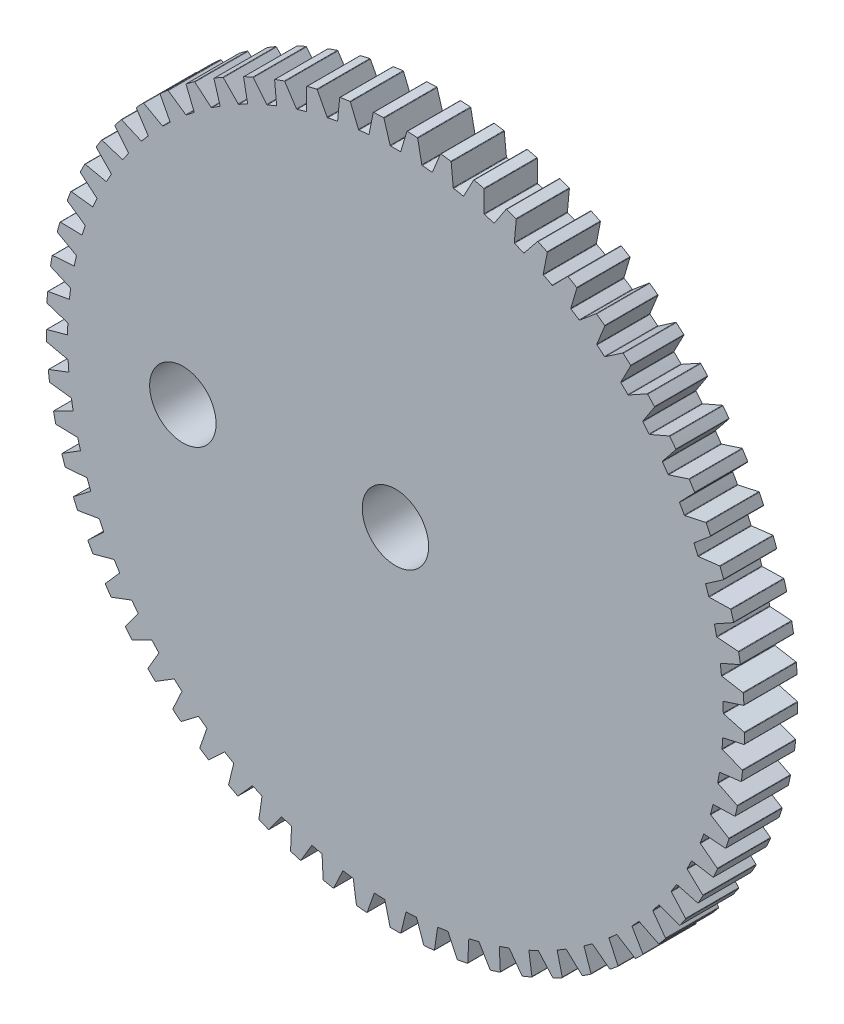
from build123d import *

# Parameters (mm, degrees)
SKETCH1_R          = 16.6878
EXTRUDE1_DEPTH     = 2.54
SKETCH2_R          = 1.5875
CUT_EXTRUDE1_DEPTH = 2.54
SKETCH3_R          = 17.878733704
CUT_EXTRUDE2_DEPTH = 42.277133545


with BuildPart() as part:
    # Sketch1 → Extrude1 (new body)
    with BuildSketch(Plane.XY):
        with Locations((-19.05, -3.81)):
            Circle(SKETCH1_R)
    extrude(amount=EXTRUDE1_DEPTH)

    # Sketch2 → Cut-Extrude1 (cut)
    with BuildSketch(Plane.XY.offset(2.54)):
        with Locations((-19.05, -3.81)):
            Circle(SKETCH2_R)
        with Locations((-29.21, -3.81)):
            Circle(SKETCH2_R)
    extrude(amount=-CUT_EXTRUDE1_DEPTH, mode=Mode.SUBTRACT)

    # Sketch3 → Cut-Extrude2 (cut, through all)
    with BuildSketch(Plane.XY.offset(2.54)):
        with Locations((-19.05, -3.81)):
            Circle(SKETCH3_R)
        with BuildLine():
            Line((-18.791282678, -20.476880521), (-18.546628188, -19.492192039))
            ThreePointArc((-18.546628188, -19.492192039), (-18.537958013, -19.478573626), (-18.52283206, -19.472931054))
            ThreePointArc((-18.52283206, -19.472931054), (-18.293052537, -19.463509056), (-18.063016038, -19.450689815))
            ThreePointArc((-18.063016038, -19.450689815), (-18.047416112, -19.454846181), (-18.037472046, -19.467564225))
            Line((-18.037472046, -19.467564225), (-17.698923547, -20.424043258))
            ThreePointArc((-17.698923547, -20.424043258), (-17.688771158, -20.436897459), (-17.672883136, -20.440881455))
            ThreePointArc((-17.672883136, -20.440881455), (-17.439394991, -20.419895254), (-17.206224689, -20.395631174))
            ThreePointArc((-17.206224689, -20.395631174), (-17.191398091, -20.388668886), (-17.183904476, -20.374103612))
            Line((-17.183904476, -20.374103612), (-17.035428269, -19.370399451))
            ThreePointArc((-17.035428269, -19.370399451), (-17.028112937, -19.356007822), (-17.014019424, -19.3489864))
            ThreePointArc((-17.014019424, -19.3489864), (-16.785804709, -19.317376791), (-16.55807934, -19.28241567))
            ThreePointArc((-16.55807934, -19.28241567), (-16.542151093, -19.285047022), (-16.531025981, -19.296745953))
            Line((-16.531025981, -19.296745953), (-16.101744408, -20.216085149))
            ThreePointArc((-16.101744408, -20.216085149), (-16.090398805, -20.227899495), (-16.074200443, -20.230331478))
            ThreePointArc((-16.074200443, -20.230331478), (-15.843827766, -20.186908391), (-15.614087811, -20.140253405))
            ThreePointArc((-15.614087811, -20.140253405), (-15.600002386, -20.131892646), (-15.593949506, -20.11667213))
            Line((-15.593949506, -20.11667213), (-15.543037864, -19.103323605))
            ThreePointArc((-15.543037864, -19.103323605), (-15.537145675, -19.08829313), (-15.52379562, -19.079944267))
            ThreePointArc((-15.52379562, -19.079944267), (-15.299697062, -19.026456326), (-15.076409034, -18.969679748))
            ThreePointArc((-15.076409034, -18.969679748), (-15.060301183, -18.970761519), (-15.048098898, -18.981332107))
            Line((-15.048098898, -18.981332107), (-14.532092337, -19.854947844))
            ThreePointArc((-14.532092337, -19.854947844), (-14.519659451, -19.865612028), (-14.503301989, -19.866469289))
            ThreePointArc((-14.503301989, -19.866469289), (-14.278195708, -19.801014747), (-14.054031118, -19.73240446))
            ThreePointArc((-14.054031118, -19.73240446), (-14.040818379, -19.722723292), (-14.036262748, -19.706989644))
            Line((-14.036262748, -19.706989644), (-14.083391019, -18.693458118))
            ThreePointArc((-14.083391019, -18.693458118), (-14.078976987, -18.677929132), (-14.066495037, -18.668330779))
            ThreePointArc((-14.066495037, -18.668330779), (-13.848604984, -18.593463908), (-13.631839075, -18.515401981))
            ThreePointArc((-13.631839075, -18.515401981), (-13.615702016, -18.51492407), (-13.602536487, -18.52426762))
            Line((-13.602536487, -18.52426762), (-13.004622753, -19.344003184))
            ThreePointArc((-13.004622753, -19.344003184), (-12.991218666, -19.353417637), (-12.974854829, -19.352692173))
            ThreePointArc((-12.974854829, -19.352692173), (-12.757116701, -19.265817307), (-12.540620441, -19.175892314))
            ThreePointArc((-12.540620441, -19.175892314), (-12.528403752, -19.164981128), (-12.525387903, -19.148881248))
            Line((-12.525387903, -19.148881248), (-12.670116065, -18.144629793))
            ThreePointArc((-12.670116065, -18.144629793), (-12.667221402, -18.128747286), (-12.655724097, -18.117989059))
            ThreePointArc((-12.655724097, -18.117989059), (-12.446076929, -18.022442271), (-12.237857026, -17.923823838))
            ThreePointArc((-12.237857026, -17.923823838), (-12.221841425, -17.921790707), (-12.207835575, -17.929819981))
            Line((-12.207835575, -17.929819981), (-11.533597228, -18.688021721))
            ThreePointArc((-11.533597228, -18.688021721), (-11.51934709, -18.696098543), (-11.503129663, -18.693797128))
            ThreePointArc((-11.503129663, -18.693797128), (-11.29479265, -18.586313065), (-11.087986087, -18.475912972))
            ThreePointArc((-11.087986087, -18.475912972), (-11.076879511, -18.463873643), (-11.075431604, -18.447557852))
            Line((-11.075431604, -18.447557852), (-11.316408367, -17.461962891))
            ThreePointArc((-11.316408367, -17.461962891), (-11.3150601, -17.445875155), (-11.304654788, -17.434057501))
            ThreePointArc((-11.304654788, -17.434057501), (-11.105207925, -17.31872289), (-10.90747812, -17.200468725))
            ThreePointArc((-10.90747812, -17.200468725), (-10.891733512, -17.196899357), (-10.877018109, -17.203539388))
            Line((-10.877018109, -17.203539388), (-10.13275033, -17.893128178))
            ThreePointArc((-10.13275033, -17.893128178), (-10.117787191, -17.899791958), (-10.101867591, -17.895936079))
            ThreePointArc((-10.101867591, -17.895936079), (-9.90487688, -17.768846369), (-9.709690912, -17.639001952))
            ThreePointArc((-9.709690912, -17.639001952), (-9.699798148, -17.625946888), (-9.699931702, -17.609567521))
            Line((-9.699931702, -17.609567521), (-10.034907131, -16.65183129))
            ThreePointArc((-10.034907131, -16.65183129), (-10.035117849, -16.635688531), (-10.025901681, -16.622921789))
            ThreePointArc((-10.025901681, -16.622921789), (-9.838517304, -16.488876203), (-9.653123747, -16.352090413))
            ThreePointArc((-9.653123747, -16.352090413), (-9.637797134, -16.347018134), (-9.622509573, -16.352206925))
            Line((-9.622509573, -16.352206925), (-8.815161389, -16.966744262))
            ThreePointArc((-8.815161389, -16.966744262), (-8.799624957, -16.971932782), (-8.784151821, -16.966558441))
            ThreePointArc((-8.784151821, -16.966558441), (-8.600346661, -16.821049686), (-8.418603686, -16.672973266))
            ThreePointArc((-8.418603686, -16.672973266), (-8.4100171, -16.659024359), (-8.411730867, -16.642734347))
            Line((-8.411730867, -16.642734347), (-8.837577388, -15.721798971))
            ThreePointArc((-8.837577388, -15.721798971), (-8.839345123, -15.705751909), (-8.831404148, -15.692155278))
            ThreePointArc((-8.831404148, -15.692155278), (-8.657831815, -15.540650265), (-8.486505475, -15.386609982))
            ThreePointArc((-8.486505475, -15.386609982), (-8.471739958, -15.380082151), (-8.456022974, -15.383771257))
            Line((-8.456022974, -15.383771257), (-7.59313238, -15.91751937))
            ThreePointArc((-7.59313238, -15.91751937), (-7.577167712, -15.921184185), (-7.562285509, -15.914341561))
            ThreePointArc((-7.562285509, -15.914341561), (-7.393382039, -15.751772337), (-7.226778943, -15.586846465))
            ThreePointArc((-7.226778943, -15.586846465), (-7.219578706, -15.572133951), (-7.222856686, -15.55608539))
            Line((-7.222856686, -15.55608539), (-7.735598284, -14.680549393))
            ThreePointArc((-7.735598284, -14.680549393), (-7.738906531, -14.664747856), (-7.732314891, -14.650448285))
            ThreePointArc((-7.732314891, -14.650448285), (-7.5741752, -14.482898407), (-7.418515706, -14.313041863))
            ThreePointArc((-7.418515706, -14.313041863), (-7.404449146, -14.305119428), (-7.388449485, -14.307274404))
            Line((-7.388449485, -14.307274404), (-6.478073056, -14.755249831))
            ThreePointArc((-6.478073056, -14.755249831), (-6.461829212, -14.757356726), (-6.447676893, -14.749109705))
            ThreePointArc((-6.447676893, -14.749109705), (-6.295252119, -14.570997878), (-6.145344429, -14.390762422))
            ThreePointArc((-6.145344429, -14.390762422), (-6.139597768, -14.375423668), (-6.144409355, -14.359766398))
            Line((-6.144409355, -14.359766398), (-6.739258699, -13.537804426))
            ThreePointArc((-6.739258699, -13.537804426), (-6.744076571, -13.522395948), (-6.738895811, -13.507526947))
            ThreePointArc((-6.738895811, -13.507526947), (-6.597665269, -13.325496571), (-6.459125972, -13.141409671))
            ThreePointArc((-6.459125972, -13.141409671), (-6.445889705, -13.132166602), (-6.429756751, -13.132767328))
            Line((-6.429756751, -13.132767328), (-5.480394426, -13.490787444))
            ThreePointArc((-5.480394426, -13.490787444), (-5.46402307, -13.491316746), (-5.450732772, -13.48174233))
            ThreePointArc((-5.450732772, -13.48174233), (-5.316209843, -13.289750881), (-5.184397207, -13.095888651))
            ThreePointArc((-5.184397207, -13.095888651), (-5.180157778, -13.080066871), (-5.186458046, -13.06494708))
            Line((-5.186458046, -13.06494708), (-5.857861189, -12.304233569))
            ThreePointArc((-5.857861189, -12.304233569), (-5.864143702, -12.289362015), (-5.860422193, -12.274062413))
            ThreePointArc((-5.860422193, -12.274062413), (-5.737419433, -12.079251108), (-5.617293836, -11.882652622))
            ThreePointArc((-5.617293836, -11.882652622), (-5.605011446, -11.872175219), (-5.588895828, -11.871216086))
            Line((-5.588895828, -11.871216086), (-4.609411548, -12.135938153))
            ThreePointArc((-4.609411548, -12.135938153), (-4.593065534, -12.13488492), (-4.580761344, -12.124072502))
            ThreePointArc((-4.580761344, -12.124072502), (-4.465396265, -11.919994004), (-4.352909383, -11.714315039))
            ThreePointArc((-4.352909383, -11.714315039), (-4.350216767, -11.698157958), (-4.357946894, -11.683716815))
            Line((-4.357946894, -11.683716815), (-5.099635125, -10.991354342))
            ThreePointArc((-5.099635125, -10.991354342), (-5.107323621, -10.977158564), (-5.10509611, -10.961571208))
            ThreePointArc((-5.10509611, -10.961571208), (-5.001469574, -10.755797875), (-4.900879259, -10.548523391))
            ThreePointArc((-4.900879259, -10.548523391), (-4.889665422, -10.536909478), (-4.873717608, -10.534399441))
            Line((-4.873717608, -10.534399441), (-3.873256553, -10.70335182))
            ThreePointArc((-3.873256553, -10.70335182), (-3.8570885, -10.700725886), (-3.8458853, -10.688776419))
            ThreePointArc((-3.8458853, -10.688776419), (-3.750755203, -10.474516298), (-3.658644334, -10.258940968))
            ThreePointArc((-3.658644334, -10.258940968), (-3.657523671, -10.242599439), (-3.666611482, -10.228971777))
            Line((-3.666611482, -10.228971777), (-4.471659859, -9.611424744))
            ThreePointArc((-4.471659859, -9.611424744), (-4.480682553, -9.598037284), (-4.479969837, -9.58230771))
            ThreePointArc((-4.479969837, -9.58230771), (-4.396687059, -9.367493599), (-4.316571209, -9.151478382))
            ThreePointArc((-4.316571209, -9.151478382), (-4.306530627, -9.138836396), (-4.290899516, -9.134798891))
            Line((-4.290899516, -9.134798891), (-3.278802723, -9.206404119))
            ThreePointArc((-3.278802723, -9.206404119), (-3.262963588, -9.202230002), (-3.252965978, -9.189255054))
            ThreePointArc((-3.252965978, -9.189255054), (-3.178959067, -8.966813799), (-3.108084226, -8.743354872))
            ThreePointArc((-3.108084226, -8.743354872), (-3.10854598, -8.726981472), (-3.118906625, -8.714294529))
            Line((-3.118906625, -8.714294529), (-3.979798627, -8.177328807))
            ThreePointArc((-3.979798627, -8.177328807), (-3.990071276, -8.16487466), (-3.990880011, -8.14914973))
            ThreePointArc((-3.990880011, -8.14914973), (-3.928718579, -7.927300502), (-3.869825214, -7.704561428))
            ThreePointArc((-3.869825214, -7.704561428), (-3.861051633, -7.691009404), (-3.845883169, -7.685482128))
            Line((-3.845883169, -7.685482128), (-2.831600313, -7.659071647))
            ThreePointArc((-2.831600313, -7.659071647), (-2.81623798, -7.653388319), (-2.807539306, -7.639509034))
            ThreePointArc((-2.807539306, -7.639509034), (-2.755346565, -7.410963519), (-2.70636949, -7.181707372))
            ThreePointArc((-2.70636949, -7.181707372), (-2.708409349, -7.165454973), (-2.719946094, -7.153827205))
            Line((-2.719946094, -7.153827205), (-3.628643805, -6.702456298))
            ThreePointArc((-3.628643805, -6.702456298), (-3.640070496, -6.691051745), (-3.64239313, -6.675478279))
            ThreePointArc((-3.64239313, -6.675478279), (-3.601933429, -6.448665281), (-3.564812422, -6.221282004))
            ThreePointArc((-3.564812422, -6.221282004), (-3.557387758, -6.206946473), (-3.542823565, -6.199981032))
            Line((-3.542823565, -6.199981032), (-2.53582473, -6.07580143))
            ThreePointArc((-2.53582473, -6.07580143), (-2.521082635, -6.068661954), (-2.513764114, -6.05400792))
            ThreePointArc((-2.513764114, -6.05400792), (-2.483872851, -5.821492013), (-2.457250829, -5.588579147))
            ThreePointArc((-2.457250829, -5.588579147), (-2.460849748, -5.572599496), (-2.473454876, -5.562139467))
            Line((-2.473454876, -5.562139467), (-3.421474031, -5.200577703))
            ThreePointArc((-3.421474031, -5.200577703), (-3.433948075, -5.190329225), (-3.437762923, -5.175052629))
            ThreePointArc((-3.437762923, -5.175052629), (-3.419382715, -4.945393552), (-3.404380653, -4.71548909))
            ThreePointArc((-3.404380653, -4.71548909), (-3.398374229, -4.700503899), (-3.384550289, -4.692165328))
            Line((-3.384550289, -4.692165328), (-2.394237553, -4.471376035))
            ThreePointArc((-2.394237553, -4.471376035), (-2.380253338, -4.462847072), (-2.3743833, -4.447555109))
            ThreePointArc((-2.3743833, -4.447555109), (-2.367072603, -4.213239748), (-2.363054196, -3.978844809))
            ThreePointArc((-2.363054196, -3.978844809), (-2.368178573, -3.963287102), (-2.381734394, -3.954092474))
            Line((-2.381734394, -3.954092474), (-3.360223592, -3.685715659))
            ThreePointArc((-3.360223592, -3.685715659), (-3.373628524, -3.676718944), (-3.378899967, -3.66188185))
            ThreePointArc((-3.378899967, -3.66188185), (-3.382770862, -3.431520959), (-3.390027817, -3.201241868))
            ThreePointArc((-3.390027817, -3.201241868), (-3.385495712, -3.18574693), (-3.372541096, -3.176113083))
            Line((-3.372541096, -3.176113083), (-2.408160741, -2.860775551))
            ThreePointArc((-2.408160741, -2.860775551), (-2.395064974, -2.850936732), (-2.390698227, -2.835149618))
            ThreePointArc((-2.390698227, -2.835149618), (-2.406036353, -2.601222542), (-2.42465908, -2.367534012))
            ThreePointArc((-2.42465908, -2.367534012), (-2.431261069, -2.352543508), (-2.445641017, -2.34470013))
            Line((-2.445641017, -2.34470013), (-3.445464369, -2.172014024))
            ThreePointArc((-3.445464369, -2.172014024), (-3.45967503, -2.164353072), (-3.466353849, -2.15009401))
            ThreePointArc((-3.466353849, -2.15009401), (-3.492439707, -1.921182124), (-3.521887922, -1.692678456))
            ThreePointArc((-3.521887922, -1.692678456), (-3.518872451, -1.676818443), (-3.506908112, -1.66597927))
            Line((-3.506908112, -1.66597927), (-2.5774643, -1.259037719))
            ThreePointArc((-2.5774643, -1.259037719), (-2.565379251, -1.247980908), (-2.562556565, -1.231846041))
            ThreePointArc((-2.562556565, -1.231846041), (-2.600400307, -1.000491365), (-2.641490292, -0.769691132))
            ThreePointArc((-2.641490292, -0.769691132), (-2.649508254, -0.755407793), (-2.664578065, -0.748988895))
            Line((-2.664578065, -0.748988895), (-3.67640049, -0.673605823))
            ThreePointArc((-3.67640049, -0.673605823), (-3.691284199, -0.667352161), (-3.699308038, -0.653804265))
            ThreePointArc((-3.699308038, -0.653804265), (-3.7473653, -0.428478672), (-3.798729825, -0.203883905))
            ThreePointArc((-3.798729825, -0.203883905), (-3.797259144, -0.187806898), (-3.78639679, -0.175863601))
            Line((-3.78639679, -0.175863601), (-2.900567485, 0.318882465))
            ThreePointArc((-2.900567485, 0.318882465), (-2.88960599, 0.331054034), (-2.888353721, 0.347386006))
            ThreePointArc((-2.888353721, 0.347386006), (-2.948349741, 0.574008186), (-3.011523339, 0.799765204))
            ThreePointArc((-3.011523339, 0.799765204), (-3.020882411, 0.813208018), (-3.036501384, 0.818142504))
            Line((-3.036501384, 0.818142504), (-4.050875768, 0.79551871))
            ThreePointArc((-4.050875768, 0.79551871), (-4.06629356, 0.800306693), (-4.075587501, 0.81301693))
            ThreePointArc((-4.075587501, 0.81301693), (-4.145167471, 1.032652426), (-4.217968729, 1.251241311))
            ThreePointArc((-4.217968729, 1.251241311), (-4.218056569, 1.267385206), (-4.208397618, 1.280321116))
            Line((-4.208397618, 1.280321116), (-3.374453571, 1.858252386))
            ThreePointArc((-3.374453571, 1.858252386), (-3.364717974, 1.871425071), (-3.365047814, 1.88780166))
            ThreePointArc((-3.365047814, 1.88780166), (-3.446635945, 2.107575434), (-3.531303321, 2.326181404))
            ThreePointArc((-3.531303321, 2.326181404), (-3.54191612, 2.338658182), (-3.557938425, 2.342062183))
            Line((-3.557938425, 2.342062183), (-4.565393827, 2.221642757))
            ThreePointArc((-4.565393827, 2.221642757), (-4.58120175, 2.224920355), (-4.591679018, 2.236674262))
            ThreePointArc((-4.591679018, 2.236674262), (-4.682132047, 2.448568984), (-4.775690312, 2.659111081))
            ThreePointArc((-4.775690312, 2.659111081), (-4.777335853, 2.675171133), (-4.768970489, 2.688978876))
            Line((-4.768970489, 2.688978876), (-3.99469801, 3.344699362))
            ThreePointArc((-3.99469801, 3.344699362), (-3.98627921, 3.358750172), (-3.988188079, 3.375018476))
            ThreePointArc((-3.988188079, 3.375018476), (-4.090606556, 3.585891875), (-4.195977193, 3.795305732))
            ThreePointArc((-4.195977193, 3.795305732), (-4.20774463, 3.806699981), (-4.22402067, 3.808541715))
            Line((-4.22402067, 3.808541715), (-5.215150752, 3.59145098))
            ThreePointArc((-5.215150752, 3.59145098), (-5.231201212, 3.593187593), (-5.242763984, 3.603875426))
            ThreePointArc((-5.242763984, 3.603875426), (-5.353245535, 3.806050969), (-5.466687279, 4.006580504))
            ThreePointArc((-5.466687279, 4.006580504), (-5.469875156, 4.022406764), (-5.462881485, 4.036957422))
            Line((-5.462881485, 4.036957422), (-4.755509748, 4.764344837))
            ThreePointArc((-4.755509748, 4.764344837), (-4.748486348, 4.779142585), (-4.751956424, 4.795150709))
            ThreePointArc((-4.751956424, 4.795150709), (-4.874248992, 4.995154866), (-4.999339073, 5.193421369))
            ThreePointArc((-4.999339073, 5.193421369), (-5.012151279, 5.203626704), (-5.02852909, 5.203888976))
            Line((-5.02852909, 5.203888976), (-5.994079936, 4.892153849))
            ThreePointArc((-5.994079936, 4.892153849), (-6.010223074, 4.892333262), (-6.022763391, 4.901855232))
            ThreePointArc((-6.022763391, 4.901855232), (-6.152241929, 5.092423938), (-6.284507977, 5.28106862))
            ThreePointArc((-6.284507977, 5.28106862), (-6.289208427, 5.296513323), (-6.283651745, 5.31167104))
            Line((-6.283651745, 5.31167104), (-5.649785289, 6.103933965))
            ThreePointArc((-5.649785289, 6.103933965), (-5.644222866, 6.119340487), (-5.649221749, 6.134938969))
            ThreePointArc((-5.649221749, 6.134938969), (-5.790246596, 6.322206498), (-5.933888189, 6.507474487))
            ThreePointArc((-5.933888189, 6.507474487), (-5.947625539, 6.516395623), (-5.963952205, 6.515075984))
            Line((-5.963952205, 6.515075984), (-6.894908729, 6.111607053))
            ThreePointArc((-6.894908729, 6.111607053), (-6.91099382, 6.110227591), (-6.924394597, 6.118494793))
            ThreePointArc((-6.924394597, 6.118494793), (-7.071661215, 6.295677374), (-7.221516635, 6.470675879))
            ThreePointArc((-7.221516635, 6.470675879), (-7.22768577, 6.485594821), (-7.22361796, 6.501218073))
            Line((-7.22361796, 6.501218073), (-6.669175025, 7.350959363))
            ThreePointArc((-6.669175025, 7.350959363), (-6.665125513, 7.366830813), (-6.67160653, 7.381874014))
            ThreePointArc((-6.67160653, 7.381874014), (-6.830046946, 7.554656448), (-6.990898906, 7.725196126))
            ThreePointArc((-6.990898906, 7.725196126), (-7.00543314, 7.732749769), (-7.021556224, 7.72986054))
            Line((-7.021556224, 7.72986054), (-7.909226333, 7.238424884))
            ThreePointArc((-7.909226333, 7.238424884), (-7.925103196, 7.235499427), (-7.939239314, 7.242434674))
            ThreePointArc((-7.939239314, 7.242434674), (-8.102919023, 7.404576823), (-8.268964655, 7.564295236))
            ThreePointArc((-8.268964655, 7.564295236), (-8.276544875, 7.578549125), (-8.274003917, 7.594492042))
            Line((-8.274003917, 7.594492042), (-7.804161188, 8.49377789))
            ThreePointArc((-7.804161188, 8.49377789), (-7.801662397, 8.509966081), (-7.809565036, 8.524313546))
            ThreePointArc((-7.809565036, 8.524313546), (-7.983941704, 8.680997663), (-8.160502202, 8.835216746))
            ThreePointArc((-8.160502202, 8.835216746), (-8.175697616, 8.84133237), (-8.191466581, 8.836900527))
            Line((-8.191466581, 8.836900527), (-9.02756234, 8.26208655))
            ThreePointArc((-9.02756234, 8.26208655), (-9.043082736, 8.257642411), (-9.057822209, 8.26318095))
            ThreePointArc((-9.057822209, 8.26318095), (-9.236386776, 8.408768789), (-9.417072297, 8.551715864))
            ThreePointArc((-9.417072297, 8.551715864), (-9.425992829, 8.565171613), (-9.425002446, 8.581285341))
            Line((-9.425002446, 8.581285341), (-9.044146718, 9.521719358))
            ThreePointArc((-9.044146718, 9.521719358), (-9.043221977, 9.538073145), (-9.052472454, 9.551590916))
            ThreePointArc((-9.052472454, 9.551590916), (-9.241157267, 9.690713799), (-9.431777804, 9.827172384))
            ThreePointArc((-9.431777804, 9.827172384), (-9.447492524, 9.83179289), (-9.462760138, 9.825859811))
            Line((-9.462760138, 9.825859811), (-10.239475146, 9.173034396))
            ThreePointArc((-10.239475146, 9.173034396), (-10.254494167, 9.16711307), (-10.269699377, 9.171203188))
            ThreePointArc((-10.269699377, 9.171203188), (-10.461481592, 9.298877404), (-10.655119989, 9.423718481))
            ThreePointArc((-10.655119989, 9.423718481), (-10.665297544, 9.436250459), (-10.665866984, 9.452384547))
            Line((-10.665866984, 9.452384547), (-10.377554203, 10.425186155))
            ThreePointArc((-10.377554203, 10.425186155), (-10.378212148, 10.441552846), (-10.388724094, 10.454114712))
            ThreePointArc((-10.388724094, 10.454114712), (-10.589955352, 10.574377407), (-10.792856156, 10.691801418))
            ThreePointArc((-10.792856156, 10.691801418), (-10.808943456, 10.694883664), (-10.823567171, 10.687504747))
            Line((-10.823567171, 10.687504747), (-11.53364945, 9.962763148))
            ThreePointArc((-11.53364945, 9.962763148), (-11.548026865, 9.95541992), (-11.563555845, 9.958023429))
            ThreePointArc((-11.563555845, 9.958023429), (-11.76676509, 10.066591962), (-11.971548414, 10.172161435))
            ThreePointArc((-11.971548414, 10.172161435), (-11.982887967, 10.183652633), (-11.985011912, 10.199656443))
            Line((-11.985011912, 10.199656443), (-11.791933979, 11.195742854))
            ThreePointArc((-11.791933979, 11.195742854), (-11.794168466, 11.211969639), (-11.805843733, 11.223458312))
            ThreePointArc((-11.805843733, 11.223458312), (-12.017742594, 11.323737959), (-12.231029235, 11.42103104))
            ThreePointArc((-12.231029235, 11.42103104), (-12.247338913, 11.422546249), (-12.261182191, 11.413790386))
            Line((-12.261182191, 11.413790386), (-12.898001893, 10.623899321))
            ThreePointArc((-12.898001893, 10.623899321), (-12.911603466, 10.615202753), (-12.927311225, 10.616295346))
            ThreePointArc((-12.927311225, 10.616295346), (-13.14005019, 10.70474452), (-13.354066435, 10.790056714))
            ThreePointArc((-13.354066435, 10.790056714), (-13.366462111, 10.800399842), (-13.370120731, 10.81612395))
            Line((-13.370120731, 10.81612395), (-13.274080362, 11.826194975))
            ThreePointArc((-13.274080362, 11.826194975), (-13.277870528, 11.842130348), (-13.290600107, 11.852438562))
            ThreePointArc((-13.290600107, 11.852438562), (-13.511188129, 11.931798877), (-13.732869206, 12.008052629))
            ThreePointArc((-13.732869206, 12.008052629), (-13.749248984, 12.007986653), (-13.762182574, 11.997935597))
            Line((-13.762182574, 11.997935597), (-14.319793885, 11.150270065))
            ThreePointArc((-14.319793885, 11.150270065), (-14.332492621, 11.140301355), (-14.348232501, 11.13987283))
            ThreePointArc((-14.348232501, 11.13987283), (-14.568514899, 11.207376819), (-14.789765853, 11.271635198))
            ThreePointArc((-14.789765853, 11.271635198), (-14.803101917, 11.280733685), (-14.808261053, 11.29603128))
            Line((-14.808261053, 11.29603128), (-14.810154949, 12.310656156))
            ThreePointArc((-14.810154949, 12.310656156), (-14.815465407, 12.326151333), (-14.829130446, 12.335182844))
            ThreePointArc((-14.829130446, 12.335182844), (-15.056348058, 12.392882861), (-15.284353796, 12.447385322))
            ThreePointArc((-15.284353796, 12.447385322), (-15.300650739, 12.445738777), (-15.312553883, 12.434486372))
            Line((-15.312553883, 12.434486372), (-15.785750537, 11.536960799))
            ThreePointArc((-15.785750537, 11.536960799), (-15.797427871, 11.525813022), (-15.813052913, 11.523867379))
            ThreePointArc((-15.813052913, 11.523867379), (-16.038822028, 11.569795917), (-16.265241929, 11.612400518))
            ThreePointArc((-16.265241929, 11.612400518), (-16.279393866, 11.620169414), (-16.286005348, 11.634897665))
            Line((-16.286005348, 11.634897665), (-16.385815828, 12.644603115))
            ThreePointArc((-16.385815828, 12.644603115), (-16.392596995, 12.659513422), (-16.407069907, 12.667183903))
            ThreePointArc((-16.407069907, 12.667183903), (-16.638795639, 12.702684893), (-16.870997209, 12.734927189))
            ThreePointArc((-16.870997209, 12.734927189), (-16.887059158, 12.731715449), (-16.89782072, 12.719366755))
            Line((-16.89782072, 12.719366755), (-17.282184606, 11.780361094))
            ThreePointArc((-17.282184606, 11.780361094), (-17.292731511, 11.768138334), (-17.308095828, 11.76469374))
            ThreePointArc((-17.308095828, 11.76469374), (-17.537243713, 11.788618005), (-17.76671854, 11.809171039))
            ThreePointArc((-17.76671854, 11.809171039), (-17.781554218, 11.815537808), (-17.789556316, 11.829559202))
            Line((-17.789556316, 11.829559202), (-17.986351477, 12.824917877))
            ThreePointArc((-17.986351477, 12.824917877), (-17.994540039, 12.8391041), (-18.009685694, 12.845341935))
            ThreePointArc((-18.009685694, 12.845341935), (-18.243755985, 12.858312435), (-18.477985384, 12.867993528))
            ThreePointArc((-18.477985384, 12.867993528), (-18.493662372, 12.86324658), (-18.503181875, 12.849916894))
            Line((-18.503181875, 12.849916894), (-18.795124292, 11.878198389))
            ThreePointArc((-18.795124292, 11.878198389), (-18.804442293, 11.865014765), (-18.819402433, 11.860103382))
            ThreePointArc((-18.819402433, 11.860103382), (-19.049789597, 11.861799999), (-19.280176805, 11.860109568))
            ThreePointArc((-19.280176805, 11.860109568), (-19.295557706, 11.865014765), (-19.304875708, 11.878198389))
            Line((-19.304875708, 11.878198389), (-19.596818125, 12.849916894))
            ThreePointArc((-19.596818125, 12.849916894), (-19.606337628, 12.86324658), (-19.622014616, 12.867993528))
            ThreePointArc((-19.622014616, 12.867993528), (-19.856244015, 12.858312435), (-20.090314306, 12.845341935))
            ThreePointArc((-20.090314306, 12.845341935), (-20.105459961, 12.8391041), (-20.113648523, 12.824917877))
            Line((-20.113648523, 12.824917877), (-20.310443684, 11.829559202))
            ThreePointArc((-20.310443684, 11.829559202), (-20.318445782, 11.815537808), (-20.332862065, 11.809205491))
            ThreePointArc((-20.332862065, 11.809205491), (-20.562337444, 11.788658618), (-20.791485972, 11.764740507))
            ThreePointArc((-20.791485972, 11.764740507), (-20.807268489, 11.768138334), (-20.817815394, 11.780361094))
            Line((-20.817815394, 11.780361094), (-21.20217928, 12.719366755))
            ThreePointArc((-21.20217928, 12.719366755), (-21.212940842, 12.731715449), (-21.229002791, 12.734927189))
            ThreePointArc((-21.229002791, 12.734927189), (-21.461204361, 12.702684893), (-21.692930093, 12.667183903))
            ThreePointArc((-21.692930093, 12.667183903), (-21.707403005, 12.659513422), (-21.714184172, 12.644603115))
            Line((-21.714184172, 12.644603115), (-21.813994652, 11.634897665))
            ThreePointArc((-21.813994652, 11.634897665), (-21.820606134, 11.620169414), (-21.83434396, 11.612475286))
            ThreePointArc((-21.83434396, 11.612475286), (-22.060765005, 11.569876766), (-22.286535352, 11.52395429))
            ThreePointArc((-22.286535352, 11.52395429), (-22.302572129, 11.525813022), (-22.314249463, 11.536960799))
            Line((-22.314249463, 11.536960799), (-22.787446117, 12.434486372))
            ThreePointArc((-22.787446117, 12.434486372), (-22.799349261, 12.445738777), (-22.815646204, 12.447385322))
            ThreePointArc((-22.815646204, 12.447385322), (-23.043651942, 12.392882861), (-23.270869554, 12.335182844))
            ThreePointArc((-23.270869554, 12.335182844), (-23.284534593, 12.326151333), (-23.289845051, 12.310656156))
            Line((-23.289845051, 12.310656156), (-23.291738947, 11.29603128))
            ThreePointArc((-23.291738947, 11.29603128), (-23.296898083, 11.280733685), (-23.309829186, 11.271749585))
            ThreePointArc((-23.309829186, 11.271749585), (-23.531081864, 11.207497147), (-23.751366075, 11.139999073))
            ThreePointArc((-23.751366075, 11.139999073), (-23.767507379, 11.140301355), (-23.780206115, 11.150270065))
            Line((-23.780206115, 11.150270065), (-24.337817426, 11.997935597))
            ThreePointArc((-24.337817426, 11.997935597), (-24.350751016, 12.007986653), (-24.367130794, 12.008052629))
            ThreePointArc((-24.367130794, 12.008052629), (-24.588811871, 11.931798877), (-24.809399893, 11.852438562))
            ThreePointArc((-24.809399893, 11.852438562), (-24.822129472, 11.842130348), (-24.825919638, 11.826194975))
            Line((-24.825919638, 11.826194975), (-24.729879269, 10.81612395))
            ThreePointArc((-24.729879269, 10.81612395), (-24.733537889, 10.800399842), (-24.745541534, 10.790209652))
            ThreePointArc((-24.745541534, 10.790209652), (-24.959560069, 10.704903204), (-25.172301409, 10.616459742))
            ThreePointArc((-25.172301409, 10.616459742), (-25.188396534, 10.615202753), (-25.201998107, 10.623899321))
            Line((-25.201998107, 10.623899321), (-25.838817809, 11.413790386))
            ThreePointArc((-25.838817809, 11.413790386), (-25.852661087, 11.422546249), (-25.868970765, 11.42103104))
            ThreePointArc((-25.868970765, 11.42103104), (-26.082257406, 11.323737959), (-26.294156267, 11.223458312))
            ThreePointArc((-26.294156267, 11.223458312), (-26.305831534, 11.211969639), (-26.308066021, 11.195742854))
            Line((-26.308066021, 11.195742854), (-26.114988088, 10.199656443))
            ThreePointArc((-26.114988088, 10.199656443), (-26.117112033, 10.183652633), (-26.128076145, 10.172351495))
            ThreePointArc((-26.128076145, 10.172351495), (-26.332862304, 10.066787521), (-26.536074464, 9.958224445))
            ThreePointArc((-26.536074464, 9.958224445), (-26.551973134, 9.95541992), (-26.56635055, 9.962763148))
            Line((-26.56635055, 9.962763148), (-27.276432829, 10.687504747))
            ThreePointArc((-27.276432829, 10.687504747), (-27.291056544, 10.694883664), (-27.307143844, 10.691801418))
            ThreePointArc((-27.307143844, 10.691801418), (-27.510044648, 10.574377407), (-27.711275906, 10.454114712))
            ThreePointArc((-27.711275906, 10.454114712), (-27.721787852, 10.441552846), (-27.722445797, 10.425186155))
            Line((-27.722445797, 10.425186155), (-27.434133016, 9.452384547))
            ThreePointArc((-27.434133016, 9.452384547), (-27.434702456, 9.436250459), (-27.444524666, 9.423943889))
            ThreePointArc((-27.444524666, 9.423943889), (-27.638166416, 9.299108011), (-27.829952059, 9.171438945))
            ThreePointArc((-27.829952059, 9.171438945), (-27.845505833, 9.16711307), (-27.860524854, 9.173034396))
            Line((-27.860524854, 9.173034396), (-28.637239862, 9.825859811))
            ThreePointArc((-28.637239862, 9.825859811), (-28.652507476, 9.83179289), (-28.668222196, 9.827172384))
            ThreePointArc((-28.668222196, 9.827172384), (-28.858842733, 9.690713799), (-29.047527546, 9.551590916))
            ThreePointArc((-29.047527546, 9.551590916), (-29.056778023, 9.538073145), (-29.055853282, 9.521719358))
            Line((-29.055853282, 9.521719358), (-28.674997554, 8.581285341))
            ThreePointArc((-28.674997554, 8.581285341), (-28.674007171, 8.565171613), (-28.682595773, 8.551974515))
            ThreePointArc((-28.682595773, 8.551974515), (-28.863285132, 8.409032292), (-29.041853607, 8.263449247))
            ThreePointArc((-29.041853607, 8.263449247), (-29.056917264, 8.257642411), (-29.07243766, 8.26208655))
            Line((-29.07243766, 8.26208655), (-29.908533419, 8.836900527))
            ThreePointArc((-29.908533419, 8.836900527), (-29.924302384, 8.84133237), (-29.939497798, 8.835216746))
            ThreePointArc((-29.939497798, 8.835216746), (-30.116058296, 8.680997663), (-30.290434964, 8.524313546))
            ThreePointArc((-30.290434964, 8.524313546), (-30.298337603, 8.509966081), (-30.295838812, 8.49377789))
            Line((-30.295838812, 8.49377789), (-29.825996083, 7.594492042))
            ThreePointArc((-29.825996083, 7.594492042), (-29.823455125, 7.578549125), (-29.830729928, 7.564584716))
            ThreePointArc((-29.830729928, 7.564584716), (-29.996779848, 7.404870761), (-30.160463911, 7.242733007))
            ThreePointArc((-30.160463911, 7.242733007), (-30.174896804, 7.235499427), (-30.190773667, 7.238424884))
            Line((-30.190773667, 7.238424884), (-31.078443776, 7.72986054))
            ThreePointArc((-31.078443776, 7.72986054), (-31.09456686, 7.732749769), (-31.109101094, 7.725196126))
            ThreePointArc((-31.109101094, 7.725196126), (-31.269953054, 7.554656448), (-31.42839347, 7.381874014))
            ThreePointArc((-31.42839347, 7.381874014), (-31.434874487, 7.366830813), (-31.430824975, 7.350959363))
            Line((-31.430824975, 7.350959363), (-30.87638204, 6.501218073))
            ThreePointArc((-30.87638204, 6.501218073), (-30.87231423, 6.485594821), (-30.878207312, 6.470993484))
            ThreePointArc((-30.878207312, 6.470993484), (-31.028067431, 6.295999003), (-31.175338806, 6.118820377))
            ThreePointArc((-31.175338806, 6.118820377), (-31.18900618, 6.110227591), (-31.205091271, 6.111607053))
            Line((-31.205091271, 6.111607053), (-32.136047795, 6.515075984))
            ThreePointArc((-32.136047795, 6.515075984), (-32.152374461, 6.516395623), (-32.166111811, 6.507474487))
            ThreePointArc((-32.166111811, 6.507474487), (-32.309753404, 6.322206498), (-32.450778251, 6.134938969))
            ThreePointArc((-32.450778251, 6.134938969), (-32.455777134, 6.119340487), (-32.450214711, 6.103933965))
            Line((-32.450214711, 6.103933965), (-31.816348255, 5.31167104))
            ThreePointArc((-31.816348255, 5.31167104), (-31.810791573, 5.296513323), (-31.815247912, 5.281411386))
            ThreePointArc((-31.815247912, 5.281411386), (-31.947519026, 5.092770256), (-32.07700268, 4.902205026))
            ThreePointArc((-32.07700268, 4.902205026), (-32.089776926, 4.892333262), (-32.105920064, 4.892153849))
            Line((-32.105920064, 4.892153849), (-33.07147091, 5.203888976))
            ThreePointArc((-33.07147091, 5.203888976), (-33.087848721, 5.203626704), (-33.100660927, 5.193421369))
            ThreePointArc((-33.100660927, 5.193421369), (-33.225751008, 4.995154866), (-33.348043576, 4.795150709))
            ThreePointArc((-33.348043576, 4.795150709), (-33.351513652, 4.779142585), (-33.344490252, 4.764344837))
            Line((-33.344490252, 4.764344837), (-32.637118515, 4.036957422))
            ThreePointArc((-32.637118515, 4.036957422), (-32.630124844, 4.022406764), (-32.633102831, 4.006945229))
            ThreePointArc((-32.633102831, 4.006945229), (-32.74654996, 3.806418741), (-32.85703694, 3.604246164))
            ThreePointArc((-32.85703694, 3.604246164), (-32.868798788, 3.593187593), (-32.884849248, 3.59145098))
            Line((-32.884849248, 3.59145098), (-33.87597933, 3.808541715))
            ThreePointArc((-33.87597933, 3.808541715), (-33.89225537, 3.806699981), (-33.904022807, 3.795305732))
            ThreePointArc((-33.904022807, 3.795305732), (-34.009393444, 3.585891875), (-34.111811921, 3.375018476))
            ThreePointArc((-34.111811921, 3.375018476), (-34.11372079, 3.358750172), (-34.10530199, 3.344699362))
            Line((-34.10530199, 3.344699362), (-33.331029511, 2.688978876))
            ThreePointArc((-33.331029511, 2.688978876), (-33.322664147, 2.675171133), (-33.324135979, 2.659494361))
            ThreePointArc((-33.324135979, 2.659494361), (-33.417699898, 2.448954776), (-33.508158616, 2.237062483))
            ThreePointArc((-33.508158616, 2.237062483), (-33.51879825, 2.224920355), (-33.534606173, 2.221642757))
            Line((-33.534606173, 2.221642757), (-34.542061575, 2.342062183))
            ThreePointArc((-34.542061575, 2.342062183), (-34.55808388, 2.338658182), (-34.568696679, 2.326181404))
            ThreePointArc((-34.568696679, 2.326181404), (-34.653364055, 2.107575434), (-34.734952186, 1.88780166))
            ThreePointArc((-34.734952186, 1.88780166), (-34.735282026, 1.871425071), (-34.725546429, 1.858252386))
            Line((-34.725546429, 1.858252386), (-33.891602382, 1.280321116))
            ThreePointArc((-33.891602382, 1.280321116), (-33.881943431, 1.267385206), (-33.881895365, 1.251639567))
            ThreePointArc((-33.881895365, 1.251639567), (-33.954702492, 1.033052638), (-34.02428836, 0.81341901))
            ThreePointArc((-34.02428836, 0.81341901), (-34.03370644, 0.800306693), (-34.049124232, 0.79551871))
            Line((-34.049124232, 0.79551871), (-35.063498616, 0.818142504))
            ThreePointArc((-35.063498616, 0.818142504), (-35.079117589, 0.813208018), (-35.088476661, 0.799765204))
            ThreePointArc((-35.088476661, 0.799765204), (-35.151650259, 0.574008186), (-35.211646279, 0.347386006))
            ThreePointArc((-35.211646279, 0.347386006), (-35.21039401, 0.331054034), (-35.199432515, 0.318882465))
            Line((-35.199432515, 0.318882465), (-34.31360321, -0.175863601))
            ThreePointArc((-34.31360321, -0.175863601), (-34.302740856, -0.187806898), (-34.301173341, -0.203474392))
            ThreePointArc((-34.301173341, -0.203474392), (-34.352543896, -0.428067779), (-34.400607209, -0.653392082))
            ThreePointArc((-34.400607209, -0.653392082), (-34.408715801, -0.667352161), (-34.42359951, -0.673605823))
            Line((-34.42359951, -0.673605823), (-35.435421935, -0.748988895))
            ThreePointArc((-35.435421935, -0.748988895), (-35.450491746, -0.755407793), (-35.458509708, -0.769691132))
            ThreePointArc((-35.458509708, -0.769691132), (-35.499599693, -1.000491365), (-35.537443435, -1.231846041))
            ThreePointArc((-35.537443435, -1.231846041), (-35.534620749, -1.247980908), (-35.5225357, -1.259037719))
            Line((-35.5225357, -1.259037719), (-34.593091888, -1.66597927))
            ThreePointArc((-34.593091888, -1.66597927), (-34.581127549, -1.676818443), (-34.57805522, -1.692261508))
            ThreePointArc((-34.57805522, -1.692261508), (-34.60750957, -1.920764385), (-34.633601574, -2.149675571))
            ThreePointArc((-34.633601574, -2.149675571), (-34.64032497, -2.164353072), (-34.654535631, -2.172014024))
            Line((-34.654535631, -2.172014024), (-35.654358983, -2.34470013))
            ThreePointArc((-35.654358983, -2.34470013), (-35.668738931, -2.352543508), (-35.67534092, -2.367534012))
            ThreePointArc((-35.67534092, -2.367534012), (-35.693963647, -2.601222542), (-35.709301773, -2.835149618))
            ThreePointArc((-35.709301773, -2.835149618), (-35.704935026, -2.850936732), (-35.691839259, -2.860775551))
            Line((-35.691839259, -2.860775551), (-34.727458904, -3.176113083))
            ThreePointArc((-34.727458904, -3.176113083), (-34.714504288, -3.18574693), (-34.709955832, -3.200821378))
            ThreePointArc((-34.709955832, -3.200821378), (-34.71721897, -3.431100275), (-34.72109605, -3.661461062))
            ThreePointArc((-34.72109605, -3.661461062), (-34.726371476, -3.676718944), (-34.739776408, -3.685715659))
            Line((-34.739776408, -3.685715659), (-35.718265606, -3.954092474))
            ThreePointArc((-35.718265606, -3.954092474), (-35.731821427, -3.963287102), (-35.736945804, -3.978844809))
            ThreePointArc((-35.736945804, -3.978844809), (-35.732927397, -4.213239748), (-35.7256167, -4.447555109))
            ThreePointArc((-35.7256167, -4.447555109), (-35.719746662, -4.462847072), (-35.705762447, -4.471376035))
            Line((-35.705762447, -4.471376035), (-34.715449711, -4.692165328))
            ThreePointArc((-34.715449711, -4.692165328), (-34.701625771, -4.700503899), (-34.695643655, -4.715068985))
            ThreePointArc((-34.695643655, -4.715068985), (-34.680647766, -4.94497385), (-34.662273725, -5.17463342))
            ThreePointArc((-34.662273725, -5.17463342), (-34.666051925, -5.190329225), (-34.678525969, -5.200577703))
            Line((-34.678525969, -5.200577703), (-35.626545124, -5.562139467))
            ThreePointArc((-35.626545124, -5.562139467), (-35.639150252, -5.572599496), (-35.642749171, -5.588579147))
            ThreePointArc((-35.642749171, -5.588579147), (-35.616127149, -5.821492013), (-35.586235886, -6.05400792))
            ThreePointArc((-35.586235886, -6.05400792), (-35.578917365, -6.068661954), (-35.56417527, -6.07580143))
            Line((-35.56417527, -6.07580143), (-34.557176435, -6.199981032))
            ThreePointArc((-34.557176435, -6.199981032), (-34.542612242, -6.206946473), (-34.535252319, -6.220866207))
            ThreePointArc((-34.535252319, -6.220866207), (-34.498137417, -6.44825048), (-34.457683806, -6.675064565))
            ThreePointArc((-34.457683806, -6.675064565), (-34.459929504, -6.691051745), (-34.471356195, -6.702456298))
            Line((-34.471356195, -6.702456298), (-35.380053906, -7.153827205))
            ThreePointArc((-35.380053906, -7.153827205), (-35.391590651, -7.165454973), (-35.39363051, -7.181707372))
            ThreePointArc((-35.39363051, -7.181707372), (-35.344653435, -7.410963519), (-35.292460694, -7.639509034))
            ThreePointArc((-35.292460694, -7.639509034), (-35.28376202, -7.653388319), (-35.268399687, -7.659071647))
            Line((-35.268399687, -7.659071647), (-34.254116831, -7.685482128))
            ThreePointArc((-34.254116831, -7.685482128), (-34.238948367, -7.691009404), (-34.230279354, -7.704153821))
            ThreePointArc((-34.230279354, -7.704153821), (-34.17139197, -7.926894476), (-34.109236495, -8.148745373))
            ThreePointArc((-34.109236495, -8.148745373), (-34.109928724, -8.16487466), (-34.120201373, -8.177328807))
            Line((-34.120201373, -8.177328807), (-34.981093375, -8.714294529))
            ThreePointArc((-34.981093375, -8.714294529), (-34.99145402, -8.726981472), (-34.991915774, -8.743354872))
            ThreePointArc((-34.991915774, -8.743354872), (-34.921040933, -8.966813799), (-34.847034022, -9.189255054))
            ThreePointArc((-34.847034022, -9.189255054), (-34.837036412, -9.202230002), (-34.821197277, -9.206404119))
            Line((-34.821197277, -9.206404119), (-33.809100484, -9.134798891))
            ThreePointArc((-33.809100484, -9.134798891), (-33.793469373, -9.138836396), (-33.783572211, -9.151082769))
            ThreePointArc((-33.783572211, -9.151082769), (-33.703462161, -9.367100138), (-33.620185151, -9.581916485))
            ThreePointArc((-33.620185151, -9.581916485), (-33.619317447, -9.598037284), (-33.628340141, -9.611424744))
            Line((-33.628340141, -9.611424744), (-34.433388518, -10.228971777))
            ThreePointArc((-34.433388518, -10.228971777), (-34.442476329, -10.242599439), (-34.441355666, -10.258940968))
            ThreePointArc((-34.441355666, -10.258940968), (-34.349244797, -10.474516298), (-34.2541147, -10.688776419))
            ThreePointArc((-34.2541147, -10.688776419), (-34.2429115, -10.700725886), (-34.226743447, -10.70335182))
            Line((-34.226743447, -10.70335182), (-33.226282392, -10.534399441))
            ThreePointArc((-33.226282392, -10.534399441), (-33.210334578, -10.536909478), (-33.199301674, -10.548143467))
            ThreePointArc((-33.199301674, -10.548143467), (-33.098716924, -10.755420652), (-32.995095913, -10.961196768))
            ThreePointArc((-32.995095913, -10.961196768), (-32.992676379, -10.977158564), (-33.000364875, -10.991354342))
            Line((-33.000364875, -10.991354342), (-33.742053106, -11.683716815))
            ThreePointArc((-33.742053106, -11.683716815), (-33.749783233, -11.698157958), (-33.747090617, -11.714315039))
            ThreePointArc((-33.747090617, -11.714315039), (-33.634603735, -11.919994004), (-33.519238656, -12.124072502))
            ThreePointArc((-33.519238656, -12.124072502), (-33.506934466, -12.13488492), (-33.490588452, -12.135938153))
            Line((-33.490588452, -12.135938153), (-32.511104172, -11.871216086))
            ThreePointArc((-32.511104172, -11.871216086), (-32.494988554, -11.872175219), (-32.482922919, -11.882291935))
            ThreePointArc((-32.482922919, -11.882291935), (-32.362802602, -12.078893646), (-32.239805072, -12.273708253))
            ThreePointArc((-32.239805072, -12.273708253), (-32.235856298, -12.289362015), (-32.24213881, -12.304233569))
            Line((-32.24213881, -12.304233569), (-32.913541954, -13.06494708))
            ThreePointArc((-32.913541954, -13.06494708), (-32.919842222, -13.080066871), (-32.915602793, -13.095888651))
            ThreePointArc((-32.915602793, -13.095888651), (-32.783790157, -13.289750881), (-32.649267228, -13.48174233))
            ThreePointArc((-32.649267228, -13.48174233), (-32.63597693, -13.491316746), (-32.619605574, -13.490787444))
            Line((-32.619605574, -13.490787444), (-31.670243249, -13.132767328))
            ThreePointArc((-31.670243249, -13.132767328), (-31.654110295, -13.132166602), (-31.641124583, -13.141071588))
            ThreePointArc((-31.641124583, -13.141071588), (-31.502590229, -13.325162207), (-31.361364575, -13.507196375))
            ThreePointArc((-31.361364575, -13.507196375), (-31.355923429, -13.522395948), (-31.360741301, -13.537804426))
            Line((-31.360741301, -13.537804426), (-31.955590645, -14.359766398))
            ThreePointArc((-31.955590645, -14.359766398), (-31.960402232, -14.375423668), (-31.954655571, -14.390762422))
            ThreePointArc((-31.954655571, -14.390762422), (-31.804747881, -14.570997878), (-31.652323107, -14.749109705))
            ThreePointArc((-31.652323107, -14.749109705), (-31.638170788, -14.757356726), (-31.621926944, -14.755249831))
            Line((-31.621926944, -14.755249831), (-30.711550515, -14.307274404))
            ThreePointArc((-30.711550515, -14.307274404), (-30.695550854, -14.305119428), (-30.681766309, -14.312729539))
            ThreePointArc((-30.681766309, -14.312729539), (-30.526111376, -14.482590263), (-30.367976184, -14.650144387))
            ThreePointArc((-30.367976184, -14.650144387), (-30.361093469, -14.664747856), (-30.364401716, -14.680549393))
            Line((-30.364401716, -14.680549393), (-30.877143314, -15.55608539))
            ThreePointArc((-30.877143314, -15.55608539), (-30.880421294, -15.572133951), (-30.873221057, -15.586846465))
            ThreePointArc((-30.873221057, -15.586846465), (-30.706617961, -15.751772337), (-30.537714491, -15.914341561))
            ThreePointArc((-30.537714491, -15.914341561), (-30.522832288, -15.921184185), (-30.50686762, -15.91751937))
            Line((-30.50686762, -15.91751937), (-29.643977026, -15.383771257))
            ThreePointArc((-29.643977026, -15.383771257), (-29.628260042, -15.380082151), (-29.613805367, -15.386326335))
            ThreePointArc((-29.613805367, -15.386326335), (-29.442483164, -15.540371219), (-29.268914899, -15.691880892))
            ThreePointArc((-29.268914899, -15.691880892), (-29.260654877, -15.705751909), (-29.262422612, -15.721798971))
            Line((-29.262422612, -15.721798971), (-29.688269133, -16.642734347))
            ThreePointArc((-29.688269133, -16.642734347), (-29.6899829, -16.659024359), (-29.681396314, -16.672973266))
            ThreePointArc((-29.681396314, -16.672973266), (-29.499653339, -16.821049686), (-29.315848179, -16.966558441))
            ThreePointArc((-29.315848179, -16.966558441), (-29.300375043, -16.971932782), (-29.284838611, -16.966744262))
            Line((-29.284838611, -16.966744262), (-28.477490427, -16.352206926))
            ThreePointArc((-28.477490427, -16.352206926), (-28.462202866, -16.347018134), (-28.44721302, -16.351838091))
            ThreePointArc((-28.44721302, -16.351838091), (-28.261823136, -16.488628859), (-28.074442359, -16.622679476))
            ThreePointArc((-28.074442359, -16.622679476), (-28.064882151, -16.635688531), (-28.065092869, -16.65183129))
            Line((-28.065092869, -16.65183129), (-28.400068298, -17.609567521))
            ThreePointArc((-28.400068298, -17.609567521), (-28.400201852, -17.625946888), (-28.390309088, -17.639001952))
            ThreePointArc((-28.390309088, -17.639001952), (-28.19512312, -17.768846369), (-27.998132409, -17.895936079))
            ThreePointArc((-27.998132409, -17.895936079), (-27.982212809, -17.899791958), (-27.96724967, -17.893128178))
            Line((-27.96724967, -17.893128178), (-27.222981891, -17.203539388))
            ThreePointArc((-27.222981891, -17.203539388), (-27.208266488, -17.196899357), (-27.192881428, -17.200250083))
            ThreePointArc((-27.192881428, -17.200250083), (-26.995154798, -17.318509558), (-26.795711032, -17.433849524))
            ThreePointArc((-26.795711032, -17.433849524), (-26.7849399, -17.445875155), (-26.783591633, -17.461962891))
            Line((-26.783591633, -17.461962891), (-27.024568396, -18.447557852))
            ThreePointArc((-27.024568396, -18.447557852), (-27.023120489, -18.463873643), (-27.012013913, -18.475912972))
            ThreePointArc((-27.012013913, -18.475912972), (-26.80520735, -18.586313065), (-26.596870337, -18.693797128))
            ThreePointArc((-26.596870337, -18.693797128), (-26.58065291, -18.696098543), (-26.566402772, -18.688021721))
            Line((-26.566402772, -18.688021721), (-25.892164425, -17.929819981))
            ThreePointArc((-25.892164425, -17.929819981), (-25.878158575, -17.921790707), (-25.862521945, -17.923640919))
            ThreePointArc((-25.862521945, -17.923640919), (-25.65430469, -18.022264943), (-25.444660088, -18.11781736))
            ThreePointArc((-25.444660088, -18.11781736), (-25.432778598, -18.128747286), (-25.429883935, -18.144629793))
            Line((-25.429883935, -18.144629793), (-25.574612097, -19.148881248))
            ThreePointArc((-25.574612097, -19.148881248), (-25.571596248, -19.164981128), (-25.559379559, -19.175892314))
            ThreePointArc((-25.559379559, -19.175892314), (-25.342883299, -19.265817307), (-25.125145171, -19.352692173))
            ThreePointArc((-25.125145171, -19.352692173), (-25.108781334, -19.353417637), (-25.095377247, -19.344003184))
            Line((-25.095377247, -19.344003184), (-24.497463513, -18.52426762))
            ThreePointArc((-24.497463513, -18.52426762), (-24.484297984, -18.51492407), (-24.468555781, -18.515256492))
            ThreePointArc((-24.468555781, -18.515256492), (-24.251791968, -18.593324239), (-24.033903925, -18.66819696))
            ThreePointArc((-24.033903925, -18.66819696), (-24.021023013, -18.677929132), (-24.016608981, -18.693458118))
            Line((-24.016608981, -18.693458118), (-24.063737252, -19.706989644))
            ThreePointArc((-24.063737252, -19.706989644), (-24.059181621, -19.722723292), (-24.045968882, -19.73240446))
            ThreePointArc((-24.045968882, -19.73240446), (-23.821804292, -19.801014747), (-23.596698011, -19.866469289))
            ThreePointArc((-23.596698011, -19.866469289), (-23.580340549, -19.865612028), (-23.567907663, -19.854947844))
            Line((-23.567907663, -19.854947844), (-23.051901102, -18.981332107))
            ThreePointArc((-23.051901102, -18.981332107), (-23.039698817, -18.970761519), (-23.023998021, -18.969573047))
            ThreePointArc((-23.023998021, -18.969573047), (-22.800711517, -19.02635562), (-22.576614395, -19.079849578))
            ThreePointArc((-22.576614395, -19.079849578), (-22.562854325, -19.08829313), (-22.556962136, -19.103323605))
            Line((-22.556962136, -19.103323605), (-22.506050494, -20.11667213))
            ThreePointArc((-22.506050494, -20.11667213), (-22.499997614, -20.131892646), (-22.485912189, -20.140253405))
            ThreePointArc((-22.485912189, -20.140253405), (-22.256172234, -20.186908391), (-22.025799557, -20.230331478))
            ThreePointArc((-22.025799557, -20.230331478), (-22.009601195, -20.227899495), (-21.998255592, -20.216085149))
            Line((-21.998255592, -20.216085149), (-21.568974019, -19.296745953))
            ThreePointArc((-21.568974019, -19.296745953), (-21.557848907, -19.285047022), (-21.542336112, -19.282348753))
            ThreePointArc((-21.542336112, -19.282348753), (-21.314611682, -19.317315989), (-21.086397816, -19.348931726))
            ThreePointArc((-21.086397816, -19.348931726), (-21.071887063, -19.356007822), (-21.064571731, -19.370399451))
            Line((-21.064571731, -19.370399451), (-20.916095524, -20.374103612))
            ThreePointArc((-20.916095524, -20.374103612), (-20.908601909, -20.388668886), (-20.893775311, -20.395631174))
            ThreePointArc((-20.893775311, -20.395631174), (-20.660605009, -20.419895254), (-20.427116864, -20.440881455))
            ThreePointArc((-20.427116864, -20.440881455), (-20.411228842, -20.436897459), (-20.401076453, -20.424043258))
            Line((-20.401076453, -20.424043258), (-20.062527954, -19.467564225))
            ThreePointArc((-20.062527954, -19.467564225), (-20.052583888, -19.454846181), (-20.036983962, -19.450689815))
            ThreePointArc((-20.036983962, -19.450689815), (-19.807367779, -19.463488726), (-19.57716794, -19.472931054))
            ThreePointArc((-19.57716794, -19.472931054), (-19.562041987, -19.478573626), (-19.553371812, -19.492192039))
            Line((-19.553371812, -19.492192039), (-19.308717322, -20.476880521))
            ThreePointArc((-19.308717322, -20.476880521), (-19.299852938, -20.490654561), (-19.284423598, -20.496153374))
            ThreePointArc((-19.284423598, -20.496153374), (-19.05, -20.4978), (-18.815576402, -20.496153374))
            ThreePointArc((-18.815576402, -20.496153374), (-18.800147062, -20.490654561), (-18.791282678, -20.476880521))
        make_face(mode=Mode.SUBTRACT)
    extrude(amount=-CUT_EXTRUDE2_DEPTH, mode=Mode.SUBTRACT)


solid = part.part
